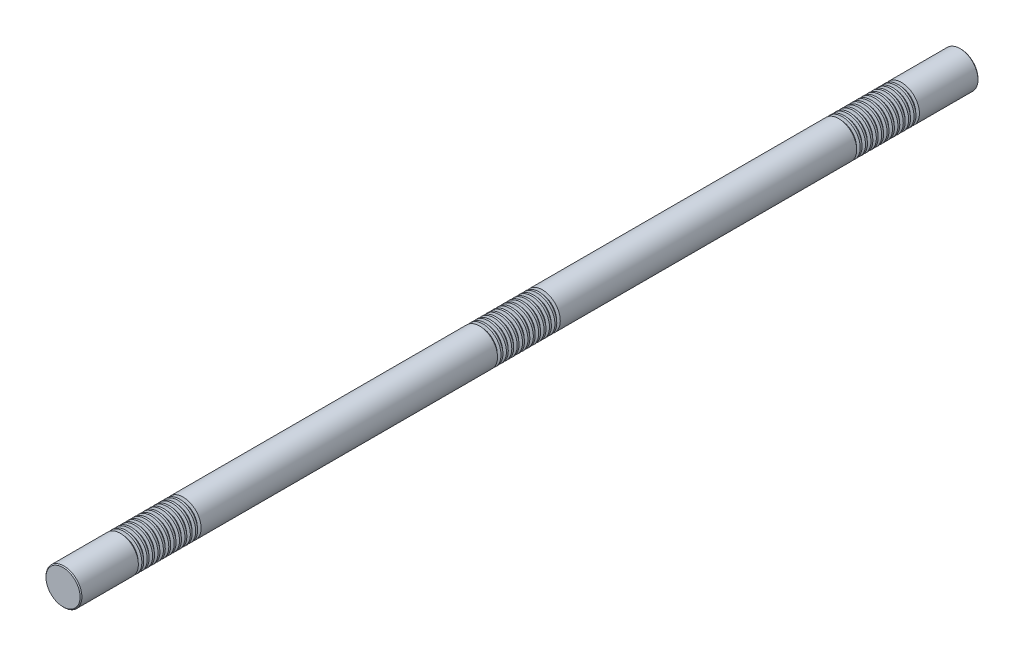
from build123d import *

# Parameters (mm, degrees)
SKETCH1_R           = 30
BOSS_EXTRUDE1_DEPTH = 750
CHAMFER1_SIZE       = 1.5
LPATTERN1_COUNT     = 12
LPATTERN1_PITCH     = 9
LPATTERN2_COUNT     = 3
LPATTERN2_PITCH     = 600


with BuildPart() as part:
    # Sketch1 → Boss-Extrude1 (new, symmetric)
    with BuildSketch(Plane.XY):
        Circle(SKETCH1_R)
    extrude(amount=BOSS_EXTRUDE1_DEPTH, both=True)

    # Chamfer1
    chamfer1_edges = [part.edges().sort_by_distance(p)[0] for p in [
        (-30, 0, -750),
        (-30, 0, 750),
    ]]
    chamfer(chamfer1_edges, length=CHAMFER1_SIZE)

    # Sketch2 → Cut-Revolve1 (revolve, cut)
    with BuildSketch(Plane(origin=(0, 0, 0), x_dir=(0, 0, -1), z_dir=(1, 0, 0)), mode=Mode.PRIVATE) as cut_revolve1_sk:
        Polygon((650.669872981, 30), (644.830127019, 30), (646.169872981, 25), (649.330127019, 25), align=None)
    cut_revolve1 = revolve(cut_revolve1_sk.sketch.rotate(Axis((0, 0, 750), (0, 0, -1)), 90), axis=Axis((0, 0, 750), (0, 0, -1)), mode=Mode.SUBTRACT)

    # LPattern1: Cut-Revolve1 ×12
    with Locations(*[(0, 0, i * LPATTERN1_PITCH) for i in range(1, LPATTERN1_COUNT)]):
        add(cut_revolve1, mode=Mode.SUBTRACT)

    # LPattern2: Cut-Revolve1 ×3
    with Locations(*[(0, 0, i * LPATTERN2_PITCH) for i in range(1, LPATTERN2_COUNT)]):
        add(cut_revolve1, mode=Mode.SUBTRACT)

    # LPattern2 copy 1 sketch → LPattern2 copy 1 (revolve, cut)
    with BuildSketch(Plane(origin=(0, 0, 609), x_dir=(0, 0, -1), z_dir=(1, 0, 0))):
        Polygon((650.669872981, 30), (644.830127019, 30), (646.169872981, 25), (649.330127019, 25), align=None)
    revolve(axis=Axis((0, 0, 1359), (0, 0, -1)), mode=Mode.SUBTRACT)

    # LPattern2 copy 2 sketch → LPattern2 copy 2 (revolve, cut)
    with BuildSketch(Plane(origin=(0, 0, 1209), x_dir=(0, 0, -1), z_dir=(1, 0, 0))):
        Polygon((650.669872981, 30), (644.830127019, 30), (646.169872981, 25), (649.330127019, 25), align=None)
    revolve(axis=Axis((0, 0, 1959), (0, 0, -1)), mode=Mode.SUBTRACT)

    # LPattern2 copy 3 sketch → LPattern2 copy 3 (revolve, cut)
    with BuildSketch(Plane(origin=(0, 0, 618), x_dir=(0, 0, -1), z_dir=(1, 0, 0))):
        Polygon((650.669872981, 30), (644.830127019, 30), (646.169872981, 25), (649.330127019, 25), align=None)
    revolve(axis=Axis((0, 0, 1368), (0, 0, -1)), mode=Mode.SUBTRACT)

    # LPattern2 copy 4 sketch → LPattern2 copy 4 (revolve, cut)
    with BuildSketch(Plane(origin=(0, 0, 1218), x_dir=(0, 0, -1), z_dir=(1, 0, 0))):
        Polygon((650.669872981, 30), (644.830127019, 30), (646.169872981, 25), (649.330127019, 25), align=None)
    revolve(axis=Axis((0, 0, 1968), (0, 0, -1)), mode=Mode.SUBTRACT)

    # LPattern2 copy 5 sketch → LPattern2 copy 5 (revolve, cut)
    with BuildSketch(Plane(origin=(0, 0, 627), x_dir=(0, 0, -1), z_dir=(1, 0, 0))):
        Polygon((650.669872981, 30), (644.830127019, 30), (646.169872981, 25), (649.330127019, 25), align=None)
    revolve(axis=Axis((0, 0, 1377), (0, 0, -1)), mode=Mode.SUBTRACT)

    # LPattern2 copy 6 sketch → LPattern2 copy 6 (revolve, cut)
    with BuildSketch(Plane(origin=(0, 0, 1227), x_dir=(0, 0, -1), z_dir=(1, 0, 0))):
        Polygon((650.669872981, 30), (644.830127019, 30), (646.169872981, 25), (649.330127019, 25), align=None)
    revolve(axis=Axis((0, 0, 1977), (0, 0, -1)), mode=Mode.SUBTRACT)

    # LPattern2 copy 7 sketch → LPattern2 copy 7 (revolve, cut)
    with BuildSketch(Plane(origin=(0, 0, 636), x_dir=(0, 0, -1), z_dir=(1, 0, 0))):
        Polygon((650.669872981, 30), (644.830127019, 30), (646.169872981, 25), (649.330127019, 25), align=None)
    revolve(axis=Axis((0, 0, 1386), (0, 0, -1)), mode=Mode.SUBTRACT)

    # LPattern2 copy 8 sketch → LPattern2 copy 8 (revolve, cut)
    with BuildSketch(Plane(origin=(0, 0, 1236), x_dir=(0, 0, -1), z_dir=(1, 0, 0))):
        Polygon((650.669872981, 30), (644.830127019, 30), (646.169872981, 25), (649.330127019, 25), align=None)
    revolve(axis=Axis((0, 0, 1986), (0, 0, -1)), mode=Mode.SUBTRACT)

    # LPattern2 copy 9 sketch → LPattern2 copy 9 (revolve, cut)
    with BuildSketch(Plane(origin=(0, 0, 645), x_dir=(0, 0, -1), z_dir=(1, 0, 0))):
        Polygon((650.669872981, 30), (644.830127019, 30), (646.169872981, 25), (649.330127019, 25), align=None)
    revolve(axis=Axis((0, 0, 1395), (0, 0, -1)), mode=Mode.SUBTRACT)

    # LPattern2 copy 10 sketch → LPattern2 copy 10 (revolve, cut)
    with BuildSketch(Plane(origin=(0, 0, 1245), x_dir=(0, 0, -1), z_dir=(1, 0, 0))):
        Polygon((650.669872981, 30), (644.830127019, 30), (646.169872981, 25), (649.330127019, 25), align=None)
    revolve(axis=Axis((0, 0, 1995), (0, 0, -1)), mode=Mode.SUBTRACT)

    # LPattern2 copy 11 sketch → LPattern2 copy 11 (revolve, cut)
    with BuildSketch(Plane(origin=(0, 0, 654), x_dir=(0, 0, -1), z_dir=(1, 0, 0))):
        Polygon((650.669872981, 30), (644.830127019, 30), (646.169872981, 25), (649.330127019, 25), align=None)
    revolve(axis=Axis((0, 0, 1404), (0, 0, -1)), mode=Mode.SUBTRACT)

    # LPattern2 copy 12 sketch → LPattern2 copy 12 (revolve, cut)
    with BuildSketch(Plane(origin=(0, 0, 1254), x_dir=(0, 0, -1), z_dir=(1, 0, 0))):
        Polygon((650.669872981, 30), (644.830127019, 30), (646.169872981, 25), (649.330127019, 25), align=None)
    revolve(axis=Axis((0, 0, 2004), (0, 0, -1)), mode=Mode.SUBTRACT)

    # LPattern2 copy 13 sketch → LPattern2 copy 13 (revolve, cut)
    with BuildSketch(Plane(origin=(0, 0, 663), x_dir=(0, 0, -1), z_dir=(1, 0, 0))):
        Polygon((650.669872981, 30), (644.830127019, 30), (646.169872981, 25), (649.330127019, 25), align=None)
    revolve(axis=Axis((0, 0, 1413), (0, 0, -1)), mode=Mode.SUBTRACT)

    # LPattern2 copy 14 sketch → LPattern2 copy 14 (revolve, cut)
    with BuildSketch(Plane(origin=(0, 0, 1263), x_dir=(0, 0, -1), z_dir=(1, 0, 0))):
        Polygon((650.669872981, 30), (644.830127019, 30), (646.169872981, 25), (649.330127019, 25), align=None)
    revolve(axis=Axis((0, 0, 2013), (0, 0, -1)), mode=Mode.SUBTRACT)

    # LPattern2 copy 15 sketch → LPattern2 copy 15 (revolve, cut)
    with BuildSketch(Plane(origin=(0, 0, 672), x_dir=(0, 0, -1), z_dir=(1, 0, 0))):
        Polygon((650.669872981, 30), (644.830127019, 30), (646.169872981, 25), (649.330127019, 25), align=None)
    revolve(axis=Axis((0, 0, 1422), (0, 0, -1)), mode=Mode.SUBTRACT)

    # LPattern2 copy 16 sketch → LPattern2 copy 16 (revolve, cut)
    with BuildSketch(Plane(origin=(0, 0, 1272), x_dir=(0, 0, -1), z_dir=(1, 0, 0))):
        Polygon((650.669872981, 30), (644.830127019, 30), (646.169872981, 25), (649.330127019, 25), align=None)
    revolve(axis=Axis((0, 0, 2022), (0, 0, -1)), mode=Mode.SUBTRACT)

    # LPattern2 copy 17 sketch → LPattern2 copy 17 (revolve, cut)
    with BuildSketch(Plane(origin=(0, 0, 681), x_dir=(0, 0, -1), z_dir=(1, 0, 0))):
        Polygon((650.669872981, 30), (644.830127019, 30), (646.169872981, 25), (649.330127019, 25), align=None)
    revolve(axis=Axis((0, 0, 1431), (0, 0, -1)), mode=Mode.SUBTRACT)

    # LPattern2 copy 18 sketch → LPattern2 copy 18 (revolve, cut)
    with BuildSketch(Plane(origin=(0, 0, 1281), x_dir=(0, 0, -1), z_dir=(1, 0, 0))):
        Polygon((650.669872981, 30), (644.830127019, 30), (646.169872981, 25), (649.330127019, 25), align=None)
    revolve(axis=Axis((0, 0, 2031), (0, 0, -1)), mode=Mode.SUBTRACT)

    # LPattern2 copy 19 sketch → LPattern2 copy 19 (revolve, cut)
    with BuildSketch(Plane(origin=(0, 0, 690), x_dir=(0, 0, -1), z_dir=(1, 0, 0))):
        Polygon((650.669872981, 30), (644.830127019, 30), (646.169872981, 25), (649.330127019, 25), align=None)
    revolve(axis=Axis((0, 0, 1440), (0, 0, -1)), mode=Mode.SUBTRACT)

    # LPattern2 copy 20 sketch → LPattern2 copy 20 (revolve, cut)
    with BuildSketch(Plane(origin=(0, 0, 1290), x_dir=(0, 0, -1), z_dir=(1, 0, 0))):
        Polygon((650.669872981, 30), (644.830127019, 30), (646.169872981, 25), (649.330127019, 25), align=None)
    revolve(axis=Axis((0, 0, 2040), (0, 0, -1)), mode=Mode.SUBTRACT)

    # LPattern2 copy 21 sketch → LPattern2 copy 21 (revolve, cut)
    with BuildSketch(Plane(origin=(0, 0, 699), x_dir=(0, 0, -1), z_dir=(1, 0, 0))):
        Polygon((650.669872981, 30), (644.830127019, 30), (646.169872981, 25), (649.330127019, 25), align=None)
    revolve(axis=Axis((0, 0, 1449), (0, 0, -1)), mode=Mode.SUBTRACT)

    # LPattern2 copy 22 sketch → LPattern2 copy 22 (revolve, cut)
    with BuildSketch(Plane(origin=(0, 0, 1299), x_dir=(0, 0, -1), z_dir=(1, 0, 0))):
        Polygon((650.669872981, 30), (644.830127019, 30), (646.169872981, 25), (649.330127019, 25), align=None)
    revolve(axis=Axis((0, 0, 2049), (0, 0, -1)), mode=Mode.SUBTRACT)


solid = part.part
